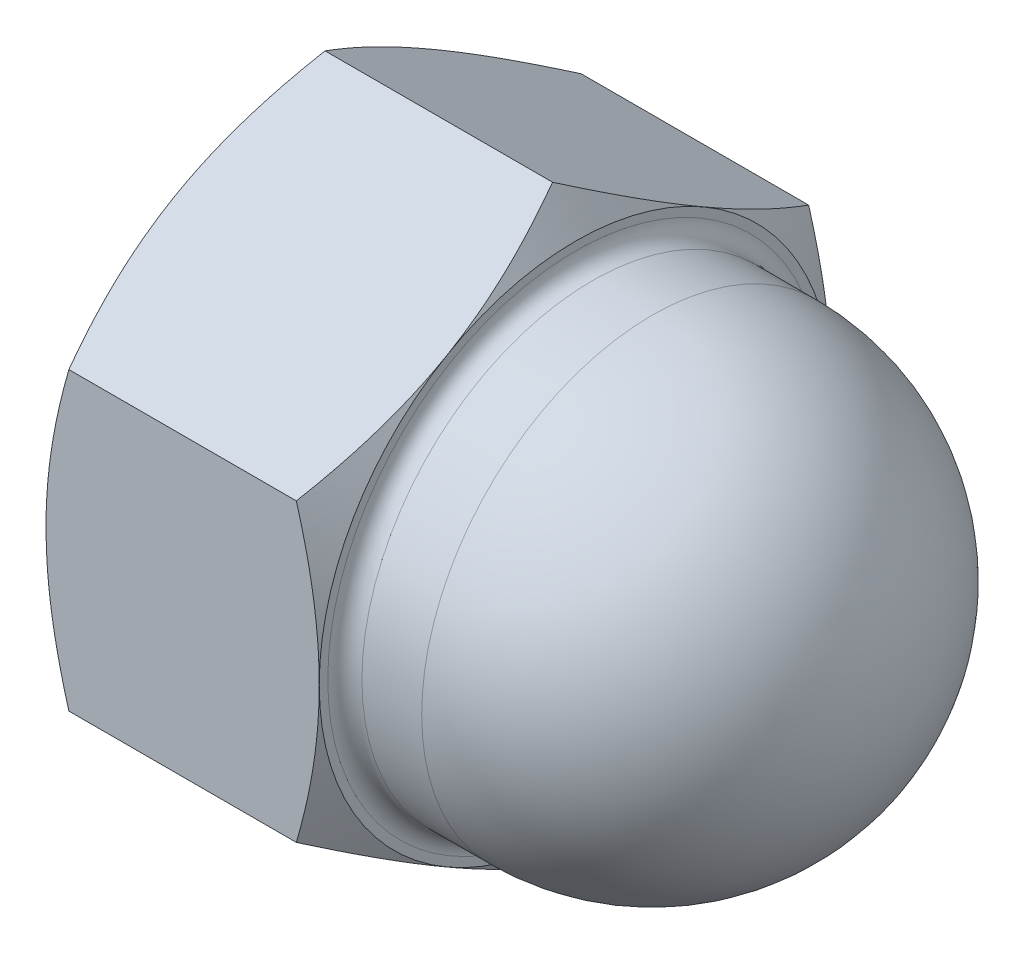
from build123d import *

# Parameters (mm, degrees)
BASENUT_DEPTH = 16
DOMEFILLET_R  = 1


with BuildPart() as part:
    # BaseNutSke → BaseNut (new body)
    with BuildSketch(Plane(origin=(0, 0, 0), x_dir=(0, 0, -1), z_dir=(1, 0, 0))):
        Polygon((15, 8.660254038), (15, -8.660254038), (0, -17.320508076), (-15, -8.660254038), (-15, 8.660254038), (0, 17.320508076), align=None)
    extrude(amount=BASENUT_DEPTH)

    # DomeSke → Dome (revolve)
    with BuildSketch(Plane.XY, mode=Mode.PRIVATE) as dome_sk:
        with BuildLine():
            Line((34, 0), (0, 0))
            Line((0, 0), (0, 13.5))
            Line((0, 13.5), (20.5, 13.5))
            ThreePointArc((20.5, 13.5), (30.045941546, 9.545941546), (34, 0))
        make_face()
    revolve(dome_sk.sketch.rotate(Axis((0, 0, 0), (1, 0, 0)), 90), axis=Axis((0, 0, 0), (1, 0, 0)))

    # Sketch4 → DoubleChamfer (revolve, cut)
    with BuildSketch(Plane.XY):
        Polygon((0, 15), (2.783121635, 19.820508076), (13.216878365, 19.820508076), (16, 15), (18, 15), (18, 30), (-2, 30), (-2, 15), align=None)
    revolve(axis=Axis((0, 0, 0), (1, 0, 0)), mode=Mode.SUBTRACT)

    # TapDriSke → TapDrill (revolve, cut)
    with BuildSketch(Plane.XY, mode=Mode.PRIVATE) as tapdrill_sk:
        Polygon((0, 8.75), (27, 8.75), (32.257530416, 0), (0, 0), align=None)
    revolve(tapdrill_sk.sketch.rotate(Axis((0, 0, 0), (1, 0, 0)), 90), axis=Axis((0, 0, 0), (1, 0, 0)), mode=Mode.SUBTRACT)

    # EndChamferSketch → EndChamfer (revolve, cut)
    with BuildSketch(Plane.XY):
        Polygon((-0.0254, 10), (0.0254, 10), (0.988185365, 8.625), (-0.0254, 8.625), align=None)
    revolve(axis=Axis((0, 0, 0), (-1, 0, 0)), mode=Mode.SUBTRACT)

    # DomeFillet
    domefillet_edges = [part.edges().sort_by_distance(p)[0] for p in [
        (16, 0, -13.5),
    ]]
    fillet(domefillet_edges, radius=DOMEFILLET_R)


solid = part.part
